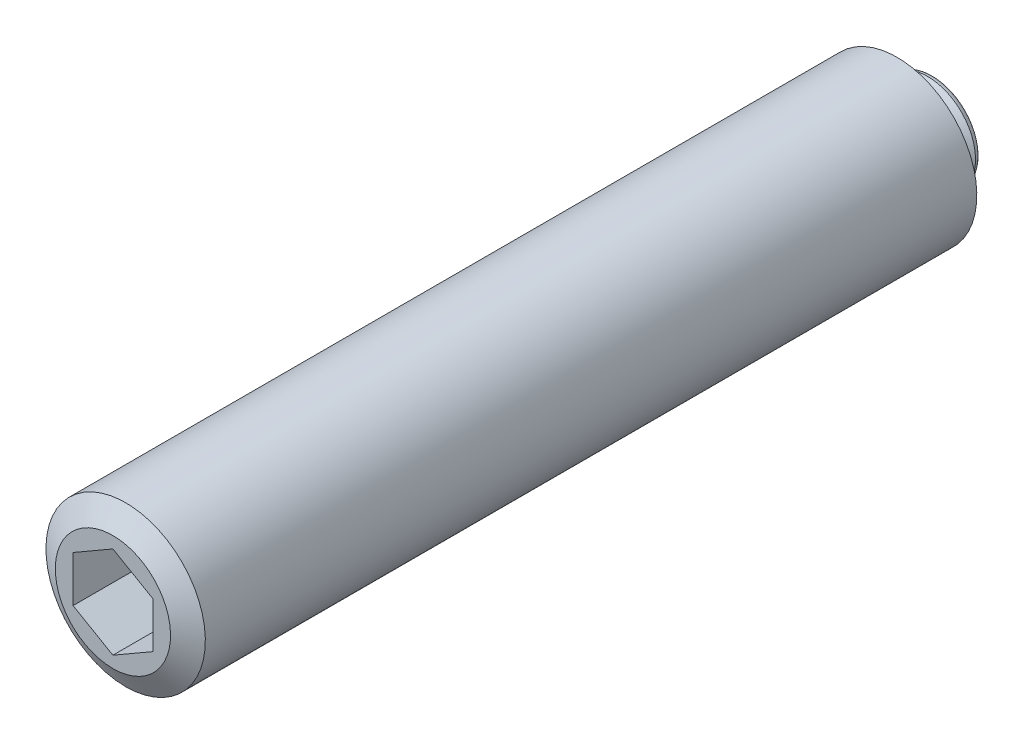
ISO-10303-21;
HEADER;
FILE_DESCRIPTION(('STEP AP214'),'2;1');
FILE_NAME('part.step','',(''),(''),'','','');
FILE_SCHEMA(('AUTOMOTIVE_DESIGN { 1 0 10303 214 1 1 1 1 }'));
ENDSEC;
DATA;
#1=APPLICATION_CONTEXT('core data for automotive mechanical design processes');
#2=APPLICATION_PROTOCOL_DEFINITION('international standard','automotive_design',2000,#1);
#3=PRODUCT_CONTEXT('',#1,'mechanical');
#4=PRODUCT('Part','Part','',(#3));
#5=PRODUCT_RELATED_PRODUCT_CATEGORY('part','',(#4));
#6=PRODUCT_DEFINITION_FORMATION('','',#4);
#7=PRODUCT_DEFINITION_CONTEXT('part definition',#1,'design');
#8=PRODUCT_DEFINITION('design','',#6,#7);
#9=PRODUCT_DEFINITION_SHAPE('','',#8);
#10=(LENGTH_UNIT() NAMED_UNIT(*) SI_UNIT(.MILLI.,.METRE.));
#11=(NAMED_UNIT(*) PLANE_ANGLE_UNIT() SI_UNIT($,.RADIAN.));
#12=(NAMED_UNIT(*) SI_UNIT($,.STERADIAN.) SOLID_ANGLE_UNIT());
#13=UNCERTAINTY_MEASURE_WITH_UNIT(LENGTH_MEASURE(1.E-05),#10,'distance_accuracy_value','');
#14=(GEOMETRIC_REPRESENTATION_CONTEXT(3) GLOBAL_UNCERTAINTY_ASSIGNED_CONTEXT((#13)) GLOBAL_UNIT_ASSIGNED_CONTEXT((#10,
#11,#12)) REPRESENTATION_CONTEXT('',''));
#15=CARTESIAN_POINT('',(0.,0.,0.));
#16=DIRECTION('',(0.,0.,1.));
#17=DIRECTION('',(1.,0.,0.));
#18=AXIS2_PLACEMENT_3D('',#15,#16,#17);
#19=CARTESIAN_POINT('',(0.,3.61435950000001,51.5));
#20=DIRECTION('',(0.,0.,-1.));
#21=DIRECTION('',(0.,-1.,0.));
#22=AXIS2_PLACEMENT_3D('',#19,#20,#21);
#23=PLANE('',#22);
#24=DIRECTION('',(-0.866025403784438,-0.5,0.));
#25=VECTOR('',#24,1.);
#26=CARTESIAN_POINT('',(0.,2.88675134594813,51.5));
#27=LINE('',#26,#25);
#28=CARTESIAN_POINT('',(0.,2.88675134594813,51.5));
#29=VERTEX_POINT('',#28);
#30=CARTESIAN_POINT('',(-2.5,1.44337567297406,51.5));
#31=VERTEX_POINT('',#30);
#32=EDGE_CURVE('E102',#29,#31,#27,.T.);
#33=ORIENTED_EDGE('',*,*,#32,.F.);
#34=DIRECTION('',(-0.866025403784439,0.5,0.));
#35=VECTOR('',#34,1.);
#36=CARTESIAN_POINT('',(2.5,1.44337567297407,51.5));
#37=LINE('',#36,#35);
#38=CARTESIAN_POINT('',(2.5,1.44337567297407,51.5));
#39=VERTEX_POINT('',#38);
#40=EDGE_CURVE('E28',#39,#29,#37,.T.);
#41=ORIENTED_EDGE('',*,*,#40,.F.);
#42=DIRECTION('',(0.,1.,0.));
#43=VECTOR('',#42,1.);
#44=CARTESIAN_POINT('',(2.5,-1.44337567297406,51.5));
#45=LINE('',#44,#43);
#46=CARTESIAN_POINT('',(2.5,-1.44337567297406,51.5));
#47=VERTEX_POINT('',#46);
#48=EDGE_CURVE('E111',#47,#39,#45,.T.);
#49=ORIENTED_EDGE('',*,*,#48,.F.);
#50=DIRECTION('',(0.866025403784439,0.5,0.));
#51=VECTOR('',#50,1.);
#52=CARTESIAN_POINT('',(0.,-2.88675134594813,51.5));
#53=LINE('',#52,#51);
#54=CARTESIAN_POINT('',(0.,-2.88675134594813,51.5));
#55=VERTEX_POINT('',#54);
#56=EDGE_CURVE('E109',#55,#47,#53,.T.);
#57=ORIENTED_EDGE('',*,*,#56,.F.);
#58=DIRECTION('',(0.866025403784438,-0.5,0.));
#59=VECTOR('',#58,1.);
#60=CARTESIAN_POINT('',(-2.5,-1.44337567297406,51.5));
#61=LINE('',#60,#59);
#62=CARTESIAN_POINT('',(-2.5,-1.44337567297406,51.5));
#63=VERTEX_POINT('',#62);
#64=EDGE_CURVE('E76',#63,#55,#61,.T.);
#65=ORIENTED_EDGE('',*,*,#64,.F.);
#66=DIRECTION('',(0.,-1.,0.));
#67=VECTOR('',#66,1.);
#68=CARTESIAN_POINT('',(-2.5,1.44337567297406,51.5));
#69=LINE('',#68,#67);
#70=EDGE_CURVE('E105',#31,#63,#69,.T.);
#71=ORIENTED_EDGE('',*,*,#70,.F.);
#72=EDGE_LOOP('',(#33,#41,#49,#57,#65,#71));
#73=FACE_BOUND('',#72,.T.);
#74=CARTESIAN_POINT('',(0.,0.,51.5));
#75=DIRECTION('',(0.,0.,-1.));
#76=DIRECTION('',(0.,-1.,0.));
#77=AXIS2_PLACEMENT_3D('',#74,#75,#76);
#78=CIRCLE('',#77,3.61435950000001);
#79=CARTESIAN_POINT('',(0.,-3.6143595,51.5));
#80=VERTEX_POINT('',#79);
#81=EDGE_CURVE('E9',#80,#80,#78,.T.);
#82=ORIENTED_EDGE('',*,*,#81,.F.);
#83=EDGE_LOOP('',(#82));
#84=FACE_BOUND('',#83,.T.);
#85=ADVANCED_FACE('F14',(#73,#84),#23,.F.);
#86=CARTESIAN_POINT('',(0.,0.,51.5));
#87=DIRECTION('',(0.,0.,-1.));
#88=DIRECTION('',(0.,-1.,0.));
#89=AXIS2_PLACEMENT_3D('',#86,#87,#88);
#90=CONICAL_SURFACE('',#89,3.61435950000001,1.0471973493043);
#91=CARTESIAN_POINT('',(0.,0.,50.7));
#92=DIRECTION('',(0.,0.,-1.));
#93=DIRECTION('',(0.,-1.,0.));
#94=AXIS2_PLACEMENT_3D('',#91,#92,#93);
#95=CIRCLE('',#94,4.9999995);
#96=CARTESIAN_POINT('',(0.,-4.9999995,50.7));
#97=VERTEX_POINT('',#96);
#98=EDGE_CURVE('E21',#97,#97,#95,.T.);
#99=ORIENTED_EDGE('',*,*,#98,.F.);
#100=EDGE_LOOP('',(#99));
#101=FACE_BOUND('',#100,.T.);
#102=ORIENTED_EDGE('',*,*,#81,.T.);
#103=EDGE_LOOP('',(#102));
#104=FACE_BOUND('',#103,.T.);
#105=ADVANCED_FACE('F145',(#101,#104),#90,.T.);
#106=CARTESIAN_POINT('',(0.,0.,0.));
#107=DIRECTION('',(0.,0.,-1.));
#108=DIRECTION('',(0.,-1.,0.));
#109=AXIS2_PLACEMENT_3D('',#106,#107,#108);
#110=CYLINDRICAL_SURFACE('',#109,4.9999995);
#111=CARTESIAN_POINT('',(0.,0.,2.3));
#112=DIRECTION('',(0.,0.,-1.));
#113=DIRECTION('',(0.,-1.,0.));
#114=AXIS2_PLACEMENT_3D('',#111,#112,#113);
#115=CIRCLE('',#114,4.9999995);
#116=CARTESIAN_POINT('',(0.,-4.9999995,2.3));
#117=VERTEX_POINT('',#116);
#118=EDGE_CURVE('E138',#117,#117,#115,.T.);
#119=ORIENTED_EDGE('',*,*,#118,.F.);
#120=EDGE_LOOP('',(#119));
#121=FACE_BOUND('',#120,.T.);
#122=ORIENTED_EDGE('',*,*,#98,.T.);
#123=EDGE_LOOP('',(#122));
#124=FACE_BOUND('',#123,.T.);
#125=ADVANCED_FACE('F143',(#121,#124),#110,.T.);
#126=CARTESIAN_POINT('',(0.,0.,2.3));
#127=DIRECTION('',(0.,0.,1.));
#128=DIRECTION('',(0.,1.,0.));
#129=AXIS2_PLACEMENT_3D('',#126,#127,#128);
#130=CONICAL_SURFACE('',#129,4.9999995,1.0471973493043);
#131=CARTESIAN_POINT('',(0.,0.,1.5));
#132=DIRECTION('',(0.,0.,-1.));
#133=DIRECTION('',(0.,-1.,0.));
#134=AXIS2_PLACEMENT_3D('',#131,#132,#133);
#135=CIRCLE('',#134,3.61435950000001);
#136=CARTESIAN_POINT('',(0.,-3.61435950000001,1.5));
#137=VERTEX_POINT('',#136);
#138=EDGE_CURVE('E135',#137,#137,#135,.T.);
#139=ORIENTED_EDGE('',*,*,#138,.F.);
#140=EDGE_LOOP('',(#139));
#141=FACE_BOUND('',#140,.T.);
#142=ORIENTED_EDGE('',*,*,#118,.T.);
#143=EDGE_LOOP('',(#142));
#144=FACE_BOUND('',#143,.T.);
#145=ADVANCED_FACE('F197',(#141,#144),#130,.T.);
#146=CARTESIAN_POINT('',(0.,3.61435950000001,1.5));
#147=DIRECTION('',(0.,0.,1.));
#148=DIRECTION('',(0.,1.,0.));
#149=AXIS2_PLACEMENT_3D('',#146,#147,#148);
#150=PLANE('',#149);
#151=CARTESIAN_POINT('',(0.,0.,1.5));
#152=DIRECTION('',(0.,0.,-1.));
#153=DIRECTION('',(0.,-1.,0.));
#154=AXIS2_PLACEMENT_3D('',#151,#152,#153);
#155=CIRCLE('',#154,2.);
#156=CARTESIAN_POINT('',(0.,-2.,1.5));
#157=VERTEX_POINT('',#156);
#158=EDGE_CURVE('E132',#157,#157,#155,.T.);
#159=ORIENTED_EDGE('',*,*,#158,.F.);
#160=EDGE_LOOP('',(#159));
#161=FACE_BOUND('',#160,.T.);
#162=ORIENTED_EDGE('',*,*,#138,.T.);
#163=EDGE_LOOP('',(#162));
#164=FACE_BOUND('',#163,.T.);
#165=ADVANCED_FACE('F193',(#161,#164),#150,.F.);
#166=CARTESIAN_POINT('',(0.,0.,0.));
#167=DIRECTION('',(0.,0.,-1.));
#168=DIRECTION('',(0.,-1.,0.));
#169=AXIS2_PLACEMENT_3D('',#166,#167,#168);
#170=CYLINDRICAL_SURFACE('',#169,2.);
#171=CARTESIAN_POINT('',(0.,0.,1.21343156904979));
#172=DIRECTION('',(0.,0.,-1.));
#173=DIRECTION('',(0.,-1.,0.));
#174=AXIS2_PLACEMENT_3D('',#171,#172,#173);
#175=CIRCLE('',#174,2.);
#176=CARTESIAN_POINT('',(0.,-2.,1.21343156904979));
#177=VERTEX_POINT('',#176);
#178=EDGE_CURVE('E129',#177,#177,#175,.T.);
#179=ORIENTED_EDGE('',*,*,#178,.F.);
#180=EDGE_LOOP('',(#179));
#181=FACE_BOUND('',#180,.T.);
#182=ORIENTED_EDGE('',*,*,#158,.T.);
#183=EDGE_LOOP('',(#182));
#184=FACE_BOUND('',#183,.T.);
#185=ADVANCED_FACE('F189',(#181,#184),#170,.T.);
#186=CARTESIAN_POINT('',(0.,0.,1.21343156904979));
#187=DIRECTION('',(0.,0.,-1.));
#188=DIRECTION('',(0.,-1.,0.));
#189=AXIS2_PLACEMENT_3D('',#186,#187,#188);
#190=TOROIDAL_SURFACE('',#189,2.254,0.254000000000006);
#191=CARTESIAN_POINT('',(0.,0.,1.0053669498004));
#192=DIRECTION('',(0.,0.,-1.));
#193=DIRECTION('',(0.,-1.,0.));
#194=AXIS2_PLACEMENT_3D('',#191,#192,#193);
#195=CIRCLE('',#194,2.10831158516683);
#196=CARTESIAN_POINT('',(0.,-2.10831158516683,1.0053669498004));
#197=VERTEX_POINT('',#196);
#198=EDGE_CURVE('E126',#197,#197,#195,.T.);
#199=ORIENTED_EDGE('',*,*,#198,.F.);
#200=EDGE_LOOP('',(#199));
#201=FACE_BOUND('',#200,.T.);
#202=ORIENTED_EDGE('',*,*,#178,.T.);
#203=EDGE_LOOP('',(#202));
#204=FACE_BOUND('',#203,.T.);
#205=ADVANCED_FACE('F185',(#201,#204),#190,.F.);
#206=CARTESIAN_POINT('',(0.,0.,1.0053669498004));
#207=DIRECTION('',(0.,0.,-1.));
#208=DIRECTION('',(0.,-1.,0.));
#209=AXIS2_PLACEMENT_3D('',#206,#207,#208);
#210=CONICAL_SURFACE('',#209,2.10831158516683,0.959931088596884);
#211=CARTESIAN_POINT('',(0.,0.,0.381));
#212=DIRECTION('',(0.,0.,-1.));
#213=DIRECTION('',(0.,-1.,0.));
#214=AXIS2_PLACEMENT_3D('',#211,#212,#213);
#215=CIRCLE('',#214,3.);
#216=CARTESIAN_POINT('',(0.,-3.,0.381));
#217=VERTEX_POINT('',#216);
#218=EDGE_CURVE('E123',#217,#217,#215,.T.);
#219=ORIENTED_EDGE('',*,*,#218,.F.);
#220=EDGE_LOOP('',(#219));
#221=FACE_BOUND('',#220,.T.);
#222=ORIENTED_EDGE('',*,*,#198,.T.);
#223=EDGE_LOOP('',(#222));
#224=FACE_BOUND('',#223,.T.);
#225=ADVANCED_FACE('F181',(#221,#224),#210,.T.);
#226=CARTESIAN_POINT('',(0.,0.,0.381));
#227=DIRECTION('',(0.,0.,-1.));
#228=DIRECTION('',(0.,-1.,0.));
#229=AXIS2_PLACEMENT_3D('',#226,#227,#228);
#230=TOROIDAL_SURFACE('',#229,2.619,0.381);
#231=CARTESIAN_POINT('',(0.,0.,0.));
#232=DIRECTION('',(0.,0.,-1.));
#233=DIRECTION('',(0.,-1.,0.));
#234=AXIS2_PLACEMENT_3D('',#231,#232,#233);
#235=CIRCLE('',#234,2.619);
#236=CARTESIAN_POINT('',(0.,-2.619,0.));
#237=VERTEX_POINT('',#236);
#238=EDGE_CURVE('E115',#237,#237,#235,.T.);
#239=ORIENTED_EDGE('',*,*,#238,.F.);
#240=EDGE_LOOP('',(#239));
#241=FACE_BOUND('',#240,.T.);
#242=ORIENTED_EDGE('',*,*,#218,.T.);
#243=EDGE_LOOP('',(#242));
#244=FACE_BOUND('',#243,.T.);
#245=ADVANCED_FACE('F173',(#241,#244),#230,.T.);
#246=CARTESIAN_POINT('',(0.,0.,0.));
#247=DIRECTION('',(0.,0.,1.));
#248=DIRECTION('',(0.,1.,0.));
#249=AXIS2_PLACEMENT_3D('',#246,#247,#248);
#250=PLANE('',#249);
#251=ORIENTED_EDGE('',*,*,#238,.T.);
#252=EDGE_LOOP('',(#251));
#253=FACE_BOUND('',#252,.T.);
#254=ADVANCED_FACE('F165',(#253),#250,.F.);
#255=CARTESIAN_POINT('',(2.5,1.44337567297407,47.5));
#256=DIRECTION('',(0.5,0.866025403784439,0.));
#257=DIRECTION('',(0.866025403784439,-0.5,0.));
#258=AXIS2_PLACEMENT_3D('',#255,#256,#257);
#259=PLANE('',#258);
#260=ORIENTED_EDGE('',*,*,#40,.T.);
#261=DIRECTION('',(0.,0.,1.));
#262=VECTOR('',#261,1.);
#263=CARTESIAN_POINT('',(0.,2.88675134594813,47.5));
#264=LINE('',#263,#262);
#265=CARTESIAN_POINT('',(0.,2.88675134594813,47.5));
#266=VERTEX_POINT('',#265);
#267=EDGE_CURVE('E58',#266,#29,#264,.T.);
#268=ORIENTED_EDGE('',*,*,#267,.F.);
#269=DIRECTION('',(-0.866025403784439,0.5,0.));
#270=VECTOR('',#269,1.);
#271=CARTESIAN_POINT('',(2.5,1.44337567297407,47.5));
#272=LINE('',#271,#270);
#273=CARTESIAN_POINT('',(2.5,1.44337567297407,47.5));
#274=VERTEX_POINT('',#273);
#275=EDGE_CURVE('E113',#274,#266,#272,.T.);
#276=ORIENTED_EDGE('',*,*,#275,.F.);
#277=DIRECTION('',(0.,0.,1.));
#278=VECTOR('',#277,1.);
#279=CARTESIAN_POINT('',(2.5,1.44337567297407,47.5));
#280=LINE('',#279,#278);
#281=EDGE_CURVE('E36',#274,#39,#280,.T.);
#282=ORIENTED_EDGE('',*,*,#281,.T.);
#283=EDGE_LOOP('',(#260,#268,#276,#282));
#284=FACE_BOUND('',#283,.T.);
#285=ADVANCED_FACE('F162',(#284),#259,.F.);
#286=CARTESIAN_POINT('',(2.5,-1.44337567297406,47.5));
#287=DIRECTION('',(1.,0.,0.));
#288=DIRECTION('',(0.,0.,-1.));
#289=AXIS2_PLACEMENT_3D('',#286,#287,#288);
#290=PLANE('',#289);
#291=ORIENTED_EDGE('',*,*,#48,.T.);
#292=ORIENTED_EDGE('',*,*,#281,.F.);
#293=DIRECTION('',(0.,1.,0.));
#294=VECTOR('',#293,1.);
#295=CARTESIAN_POINT('',(2.5,-1.44337567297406,47.5));
#296=LINE('',#295,#294);
#297=CARTESIAN_POINT('',(2.5,-1.44337567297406,47.5));
#298=VERTEX_POINT('',#297);
#299=EDGE_CURVE('E88',#298,#274,#296,.T.);
#300=ORIENTED_EDGE('',*,*,#299,.F.);
#301=DIRECTION('',(0.,0.,1.));
#302=VECTOR('',#301,1.);
#303=CARTESIAN_POINT('',(2.5,-1.44337567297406,47.5));
#304=LINE('',#303,#302);
#305=EDGE_CURVE('E80',#298,#47,#304,.T.);
#306=ORIENTED_EDGE('',*,*,#305,.T.);
#307=EDGE_LOOP('',(#291,#292,#300,#306));
#308=FACE_BOUND('',#307,.T.);
#309=ADVANCED_FACE('F164',(#308),#290,.F.);
#310=CARTESIAN_POINT('',(0.,-2.88675134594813,47.5));
#311=DIRECTION('',(0.5,-0.866025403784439,0.));
#312=DIRECTION('',(-0.866025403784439,-0.5,0.));
#313=AXIS2_PLACEMENT_3D('',#310,#311,#312);
#314=PLANE('',#313);
#315=ORIENTED_EDGE('',*,*,#56,.T.);
#316=ORIENTED_EDGE('',*,*,#305,.F.);
#317=DIRECTION('',(0.866025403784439,0.5,0.));
#318=VECTOR('',#317,1.);
#319=CARTESIAN_POINT('',(0.,-2.88675134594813,47.5));
#320=LINE('',#319,#318);
#321=CARTESIAN_POINT('',(0.,-2.88675134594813,47.5));
#322=VERTEX_POINT('',#321);
#323=EDGE_CURVE('E84',#322,#298,#320,.T.);
#324=ORIENTED_EDGE('',*,*,#323,.F.);
#325=DIRECTION('',(0.,0.,1.));
#326=VECTOR('',#325,1.);
#327=CARTESIAN_POINT('',(0.,-2.88675134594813,47.5));
#328=LINE('',#327,#326);
#329=EDGE_CURVE('E69',#322,#55,#328,.T.);
#330=ORIENTED_EDGE('',*,*,#329,.T.);
#331=EDGE_LOOP('',(#315,#316,#324,#330));
#332=FACE_BOUND('',#331,.T.);
#333=ADVANCED_FACE('F85',(#332),#314,.F.);
#334=CARTESIAN_POINT('',(-2.5,-1.44337567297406,47.5));
#335=DIRECTION('',(-0.5,-0.866025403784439,0.));
#336=DIRECTION('',(-0.866025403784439,0.5,0.));
#337=AXIS2_PLACEMENT_3D('',#334,#335,#336);
#338=PLANE('',#337);
#339=ORIENTED_EDGE('',*,*,#64,.T.);
#340=ORIENTED_EDGE('',*,*,#329,.F.);
#341=DIRECTION('',(0.866025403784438,-0.5,0.));
#342=VECTOR('',#341,1.);
#343=CARTESIAN_POINT('',(-2.5,-1.44337567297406,47.5));
#344=LINE('',#343,#342);
#345=CARTESIAN_POINT('',(-2.5,-1.44337567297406,47.5));
#346=VERTEX_POINT('',#345);
#347=EDGE_CURVE('E73',#346,#322,#344,.T.);
#348=ORIENTED_EDGE('',*,*,#347,.F.);
#349=DIRECTION('',(0.,0.,1.));
#350=VECTOR('',#349,1.);
#351=CARTESIAN_POINT('',(-2.5,-1.44337567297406,47.5));
#352=LINE('',#351,#350);
#353=EDGE_CURVE('E81',#346,#63,#352,.T.);
#354=ORIENTED_EDGE('',*,*,#353,.T.);
#355=EDGE_LOOP('',(#339,#340,#348,#354));
#356=FACE_BOUND('',#355,.T.);
#357=ADVANCED_FACE('F71',(#356),#338,.F.);
#358=CARTESIAN_POINT('',(-2.5,1.44337567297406,47.5));
#359=DIRECTION('',(-1.,0.,0.));
#360=DIRECTION('',(0.,0.,1.));
#361=AXIS2_PLACEMENT_3D('',#358,#359,#360);
#362=PLANE('',#361);
#363=ORIENTED_EDGE('',*,*,#70,.T.);
#364=ORIENTED_EDGE('',*,*,#353,.F.);
#365=DIRECTION('',(0.,-1.,0.));
#366=VECTOR('',#365,1.);
#367=CARTESIAN_POINT('',(-2.5,1.44337567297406,47.5));
#368=LINE('',#367,#366);
#369=CARTESIAN_POINT('',(-2.5,1.44337567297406,47.5));
#370=VERTEX_POINT('',#369);
#371=EDGE_CURVE('E94',#370,#346,#368,.T.);
#372=ORIENTED_EDGE('',*,*,#371,.F.);
#373=DIRECTION('',(0.,0.,1.));
#374=VECTOR('',#373,1.);
#375=CARTESIAN_POINT('',(-2.5,1.44337567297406,47.5));
#376=LINE('',#375,#374);
#377=EDGE_CURVE('E118',#370,#31,#376,.T.);
#378=ORIENTED_EDGE('',*,*,#377,.T.);
#379=EDGE_LOOP('',(#363,#364,#372,#378));
#380=FACE_BOUND('',#379,.T.);
#381=ADVANCED_FACE('F291',(#380),#362,.F.);
#382=CARTESIAN_POINT('',(0.,2.88675134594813,47.5));
#383=DIRECTION('',(-0.5,0.866025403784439,0.));
#384=DIRECTION('',(0.866025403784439,0.5,0.));
#385=AXIS2_PLACEMENT_3D('',#382,#383,#384);
#386=PLANE('',#385);
#387=ORIENTED_EDGE('',*,*,#32,.T.);
#388=ORIENTED_EDGE('',*,*,#377,.F.);
#389=DIRECTION('',(-0.866025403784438,-0.5,0.));
#390=VECTOR('',#389,1.);
#391=CARTESIAN_POINT('',(0.,2.88675134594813,47.5));
#392=LINE('',#391,#390);
#393=EDGE_CURVE('E96',#266,#370,#392,.T.);
#394=ORIENTED_EDGE('',*,*,#393,.F.);
#395=ORIENTED_EDGE('',*,*,#267,.T.);
#396=EDGE_LOOP('',(#387,#388,#394,#395));
#397=FACE_BOUND('',#396,.T.);
#398=ADVANCED_FACE('F160',(#397),#386,.F.);
#399=CARTESIAN_POINT('',(0.,2.88675134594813,47.5));
#400=DIRECTION('',(0.,0.,1.));
#401=DIRECTION('',(0.,1.,0.));
#402=AXIS2_PLACEMENT_3D('',#399,#400,#401);
#403=PLANE('',#402);
#404=ORIENTED_EDGE('',*,*,#275,.T.);
#405=ORIENTED_EDGE('',*,*,#393,.T.);
#406=ORIENTED_EDGE('',*,*,#371,.T.);
#407=ORIENTED_EDGE('',*,*,#347,.T.);
#408=ORIENTED_EDGE('',*,*,#323,.T.);
#409=ORIENTED_EDGE('',*,*,#299,.T.);
#410=EDGE_LOOP('',(#404,#405,#406,#407,#408,#409));
#411=FACE_BOUND('',#410,.T.);
#412=ADVANCED_FACE('F91',(#411),#403,.T.);
#413=CLOSED_SHELL('',(#85,#105,#125,#145,#165,#185,#205,#225,#245,#254,#285,#309,#333,#357,#381,
#398,#412));
#414=MANIFOLD_SOLID_BREP('B1',#413);
#415=ADVANCED_BREP_SHAPE_REPRESENTATION('',(#18,#414),#14);
#416=SHAPE_DEFINITION_REPRESENTATION(#9,#415);
ENDSEC;
END-ISO-10303-21;
